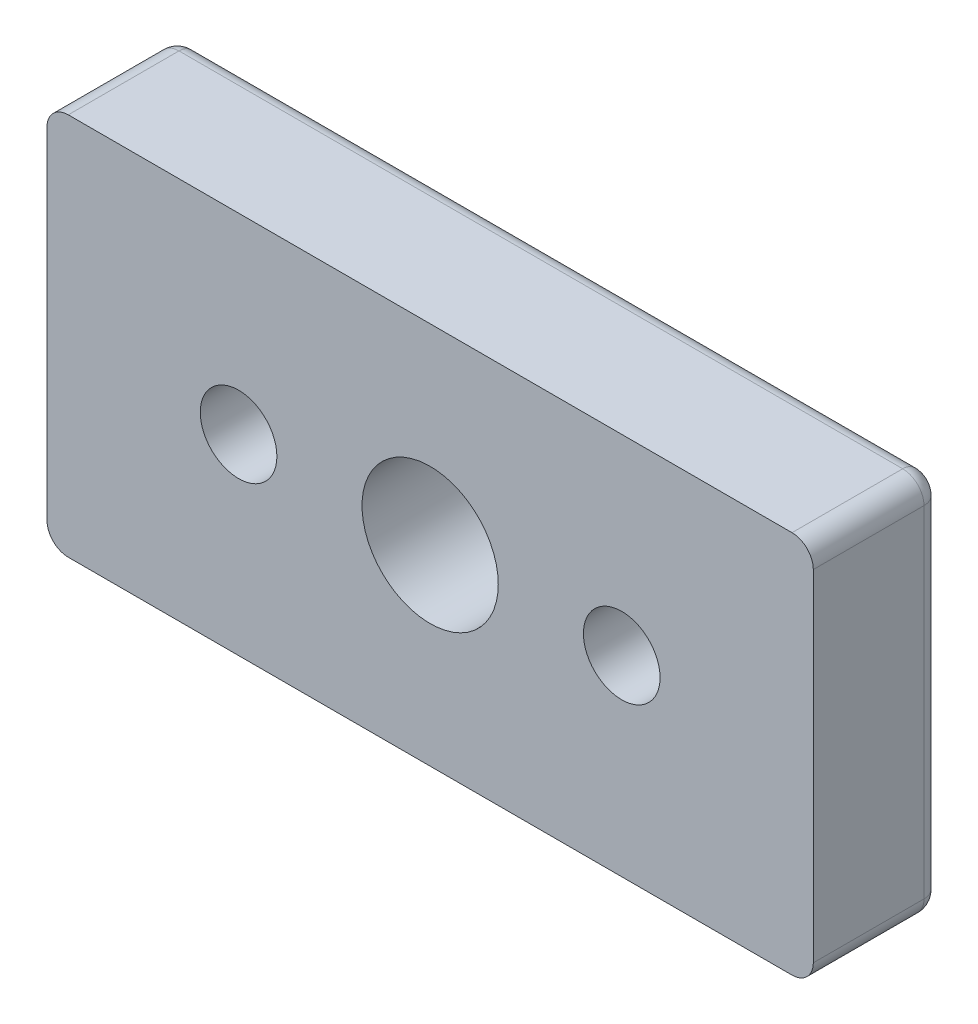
ISO-10303-21;
HEADER;
FILE_DESCRIPTION(('STEP AP214'),'2;1');
FILE_NAME('part.step','',(''),(''),'','','');
FILE_SCHEMA(('AUTOMOTIVE_DESIGN { 1 0 10303 214 1 1 1 1 }'));
ENDSEC;
DATA;
#1=APPLICATION_CONTEXT('core data for automotive mechanical design processes');
#2=APPLICATION_PROTOCOL_DEFINITION('international standard','automotive_design',2000,#1);
#3=PRODUCT_CONTEXT('',#1,'mechanical');
#4=PRODUCT('Part','Part','',(#3));
#5=PRODUCT_RELATED_PRODUCT_CATEGORY('part','',(#4));
#6=PRODUCT_DEFINITION_FORMATION('','',#4);
#7=PRODUCT_DEFINITION_CONTEXT('part definition',#1,'design');
#8=PRODUCT_DEFINITION('design','',#6,#7);
#9=PRODUCT_DEFINITION_SHAPE('','',#8);
#10=(LENGTH_UNIT() NAMED_UNIT(*) SI_UNIT(.MILLI.,.METRE.));
#11=(NAMED_UNIT(*) PLANE_ANGLE_UNIT() SI_UNIT($,.RADIAN.));
#12=(NAMED_UNIT(*) SI_UNIT($,.STERADIAN.) SOLID_ANGLE_UNIT());
#13=UNCERTAINTY_MEASURE_WITH_UNIT(LENGTH_MEASURE(1.E-05),#10,'distance_accuracy_value','');
#14=(GEOMETRIC_REPRESENTATION_CONTEXT(3) GLOBAL_UNCERTAINTY_ASSIGNED_CONTEXT((#13)) GLOBAL_UNIT_ASSIGNED_CONTEXT((#10,
#11,#12)) REPRESENTATION_CONTEXT('',''));
#15=CARTESIAN_POINT('',(0.,0.,0.));
#16=DIRECTION('',(0.,0.,1.));
#17=DIRECTION('',(1.,0.,0.));
#18=AXIS2_PLACEMENT_3D('',#15,#16,#17);
#19=CARTESIAN_POINT('',(22.5,0.,0.));
#20=DIRECTION('',(0.,0.,1.));
#21=DIRECTION('',(1.,0.,0.));
#22=AXIS2_PLACEMENT_3D('',#19,#20,#21);
#23=CYLINDRICAL_SURFACE('',#22,7.5);
#24=CARTESIAN_POINT('',(22.5,0.,5.5));
#25=DIRECTION('',(0.,0.,1.));
#26=DIRECTION('',(1.,0.,0.));
#27=AXIS2_PLACEMENT_3D('',#24,#25,#26);
#28=CIRCLE('',#27,7.5);
#29=CARTESIAN_POINT('',(30.,0.,5.5));
#30=VERTEX_POINT('',#29);
#31=EDGE_CURVE('E193',#30,#30,#28,.T.);
#32=ORIENTED_EDGE('',*,*,#31,.T.);
#33=EDGE_LOOP('',(#32));
#34=FACE_BOUND('',#33,.T.);
#35=CARTESIAN_POINT('',(22.5,0.,0.));
#36=DIRECTION('',(0.,0.,1.));
#37=DIRECTION('',(1.,0.,0.));
#38=AXIS2_PLACEMENT_3D('',#35,#36,#37);
#39=CIRCLE('',#38,7.5);
#40=CARTESIAN_POINT('',(30.,0.,0.));
#41=VERTEX_POINT('',#40);
#42=EDGE_CURVE('E196',#41,#41,#39,.F.);
#43=ORIENTED_EDGE('',*,*,#42,.T.);
#44=EDGE_LOOP('',(#43));
#45=FACE_BOUND('',#44,.T.);
#46=ADVANCED_FACE('F15',(#34,#45),#23,.F.);
#47=CARTESIAN_POINT('',(-22.5,0.,0.));
#48=DIRECTION('',(0.,0.,1.));
#49=DIRECTION('',(1.,0.,0.));
#50=AXIS2_PLACEMENT_3D('',#47,#48,#49);
#51=CYLINDRICAL_SURFACE('',#50,7.5);
#52=CARTESIAN_POINT('',(-22.5,0.,5.5));
#53=DIRECTION('',(0.,0.,1.));
#54=DIRECTION('',(1.,0.,0.));
#55=AXIS2_PLACEMENT_3D('',#52,#53,#54);
#56=CIRCLE('',#55,7.5);
#57=CARTESIAN_POINT('',(-15.,0.,5.5));
#58=VERTEX_POINT('',#57);
#59=EDGE_CURVE('E129',#58,#58,#56,.T.);
#60=ORIENTED_EDGE('',*,*,#59,.T.);
#61=EDGE_LOOP('',(#60));
#62=FACE_BOUND('',#61,.T.);
#63=CARTESIAN_POINT('',(-22.5,0.,0.));
#64=DIRECTION('',(0.,0.,1.));
#65=DIRECTION('',(1.,0.,0.));
#66=AXIS2_PLACEMENT_3D('',#63,#64,#65);
#67=CIRCLE('',#66,7.5);
#68=CARTESIAN_POINT('',(-15.,0.,0.));
#69=VERTEX_POINT('',#68);
#70=EDGE_CURVE('E199',#69,#69,#67,.F.);
#71=ORIENTED_EDGE('',*,*,#70,.T.);
#72=EDGE_LOOP('',(#71));
#73=FACE_BOUND('',#72,.T.);
#74=ADVANCED_FACE('F443',(#62,#73),#51,.F.);
#75=CARTESIAN_POINT('',(-21.25,20.5,2.));
#76=DIRECTION('',(-1.,0.,0.));
#77=DIRECTION('',(0.,0.,1.));
#78=AXIS2_PLACEMENT_3D('',#75,#76,#77);
#79=CYLINDRICAL_SURFACE('',#78,2.);
#80=CARTESIAN_POINT('',(-42.5,20.5,1.99999999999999));
#81=DIRECTION('',(-1.,0.,0.));
#82=DIRECTION('',(0.,0.,1.));
#83=AXIS2_PLACEMENT_3D('',#80,#81,#82);
#84=CIRCLE('',#83,2.);
#85=CARTESIAN_POINT('',(-42.5,22.5,2.));
#86=VERTEX_POINT('',#85);
#87=CARTESIAN_POINT('',(-42.5,20.5,0.));
#88=VERTEX_POINT('',#87);
#89=EDGE_CURVE('E84',#86,#88,#84,.T.);
#90=ORIENTED_EDGE('',*,*,#89,.F.);
#91=DIRECTION('',(1.,0.,0.));
#92=VECTOR('',#91,1.);
#93=CARTESIAN_POINT('',(-42.5,22.5,2.));
#94=LINE('',#93,#92);
#95=CARTESIAN_POINT('',(42.5,22.5,2.));
#96=VERTEX_POINT('',#95);
#97=EDGE_CURVE('E125',#96,#86,#94,.F.);
#98=ORIENTED_EDGE('',*,*,#97,.F.);
#99=CARTESIAN_POINT('',(42.5000000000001,20.5,1.99999999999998));
#100=DIRECTION('',(1.,0.,0.));
#101=DIRECTION('',(0.,0.,-1.));
#102=AXIS2_PLACEMENT_3D('',#99,#100,#101);
#103=CIRCLE('',#102,1.99999999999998);
#104=CARTESIAN_POINT('',(42.5,20.5,0.));
#105=VERTEX_POINT('',#104);
#106=EDGE_CURVE('E97',#105,#96,#103,.T.);
#107=ORIENTED_EDGE('',*,*,#106,.F.);
#108=DIRECTION('',(1.,0.,0.));
#109=VECTOR('',#108,1.);
#110=CARTESIAN_POINT('',(0.,20.5,0.));
#111=LINE('',#110,#109);
#112=EDGE_CURVE('E202',#105,#88,#111,.F.);
#113=ORIENTED_EDGE('',*,*,#112,.T.);
#114=EDGE_LOOP('',(#90,#98,#107,#113));
#115=FACE_BOUND('',#114,.T.);
#116=ADVANCED_FACE('F253',(#115),#79,.T.);
#117=CARTESIAN_POINT('',(-42.5,20.,2.));
#118=DIRECTION('',(0.,0.,-1.));
#119=DIRECTION('',(-1.,0.,0.));
#120=AXIS2_PLACEMENT_3D('',#117,#118,#119);
#121=DEGENERATE_TOROIDAL_SURFACE('',#120,0.5,2.,.T.);
#122=ORIENTED_EDGE('',*,*,#89,.T.);
#123=CARTESIAN_POINT('',(-42.5,20.,0.));
#124=DIRECTION('',(0.,0.,-1.));
#125=DIRECTION('',(-1.,0.,0.));
#126=AXIS2_PLACEMENT_3D('',#123,#124,#125);
#127=CIRCLE('',#126,0.500000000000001);
#128=CARTESIAN_POINT('',(-43.,20.,0.));
#129=VERTEX_POINT('',#128);
#130=EDGE_CURVE('E19',#88,#129,#127,.F.);
#131=ORIENTED_EDGE('',*,*,#130,.T.);
#132=CARTESIAN_POINT('',(-43.,20.,2.));
#133=DIRECTION('',(0.,-1.,0.));
#134=DIRECTION('',(0.,0.,-1.));
#135=AXIS2_PLACEMENT_3D('',#132,#133,#134);
#136=CIRCLE('',#135,2.);
#137=CARTESIAN_POINT('',(-45.,20.,2.));
#138=VERTEX_POINT('',#137);
#139=EDGE_CURVE('E91',#138,#129,#136,.T.);
#140=ORIENTED_EDGE('',*,*,#139,.F.);
#141=CARTESIAN_POINT('',(-42.5,20.,2.));
#142=DIRECTION('',(0.,0.,1.));
#143=DIRECTION('',(1.,0.,0.));
#144=AXIS2_PLACEMENT_3D('',#141,#142,#143);
#145=CIRCLE('',#144,2.5);
#146=EDGE_CURVE('E128',#86,#138,#145,.T.);
#147=ORIENTED_EDGE('',*,*,#146,.F.);
#148=EDGE_LOOP('',(#122,#131,#140,#147));
#149=FACE_BOUND('',#148,.T.);
#150=ADVANCED_FACE('F89',(#149),#121,.T.);
#151=CARTESIAN_POINT('',(-43.,-10.,2.));
#152=DIRECTION('',(0.,-1.,0.));
#153=DIRECTION('',(0.,0.,-1.));
#154=AXIS2_PLACEMENT_3D('',#151,#152,#153);
#155=CYLINDRICAL_SURFACE('',#154,2.);
#156=ORIENTED_EDGE('',*,*,#139,.T.);
#157=DIRECTION('',(0.,1.,0.));
#158=VECTOR('',#157,1.);
#159=CARTESIAN_POINT('',(-43.,0.,0.));
#160=LINE('',#159,#158);
#161=CARTESIAN_POINT('',(-43.,-20.,0.));
#162=VERTEX_POINT('',#161);
#163=EDGE_CURVE('E96',#129,#162,#160,.F.);
#164=ORIENTED_EDGE('',*,*,#163,.T.);
#165=CARTESIAN_POINT('',(-43.,-20.,2.00000000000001));
#166=DIRECTION('',(0.,-1.,0.));
#167=DIRECTION('',(0.,0.,-1.));
#168=AXIS2_PLACEMENT_3D('',#165,#166,#167);
#169=CIRCLE('',#168,2.);
#170=CARTESIAN_POINT('',(-45.,-20.,2.));
#171=VERTEX_POINT('',#170);
#172=EDGE_CURVE('E105',#171,#162,#169,.T.);
#173=ORIENTED_EDGE('',*,*,#172,.F.);
#174=DIRECTION('',(0.,1.,0.));
#175=VECTOR('',#174,1.);
#176=CARTESIAN_POINT('',(-45.,-20.,2.));
#177=LINE('',#176,#175);
#178=EDGE_CURVE('E103',#138,#171,#177,.F.);
#179=ORIENTED_EDGE('',*,*,#178,.F.);
#180=EDGE_LOOP('',(#156,#164,#173,#179));
#181=FACE_BOUND('',#180,.T.);
#182=ADVANCED_FACE('F99',(#181),#155,.T.);
#183=CARTESIAN_POINT('',(-42.5,-20.,2.00000000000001));
#184=DIRECTION('',(0.,0.,-1.));
#185=DIRECTION('',(-1.,0.,0.));
#186=AXIS2_PLACEMENT_3D('',#183,#184,#185);
#187=DEGENERATE_TOROIDAL_SURFACE('',#186,0.500000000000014,2.,.T.);
#188=ORIENTED_EDGE('',*,*,#172,.T.);
#189=CARTESIAN_POINT('',(-42.5,-20.,0.));
#190=DIRECTION('',(0.,0.,-1.));
#191=DIRECTION('',(-1.,0.,0.));
#192=AXIS2_PLACEMENT_3D('',#189,#190,#191);
#193=CIRCLE('',#192,0.49999999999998);
#194=CARTESIAN_POINT('',(-42.5,-20.5,0.));
#195=VERTEX_POINT('',#194);
#196=EDGE_CURVE('E111',#162,#195,#193,.F.);
#197=ORIENTED_EDGE('',*,*,#196,.T.);
#198=CARTESIAN_POINT('',(-42.5,-20.5,2.));
#199=DIRECTION('',(1.,0.,0.));
#200=DIRECTION('',(0.,0.,-1.));
#201=AXIS2_PLACEMENT_3D('',#198,#199,#200);
#202=CIRCLE('',#201,2.);
#203=CARTESIAN_POINT('',(-42.5,-22.5,2.));
#204=VERTEX_POINT('',#203);
#205=EDGE_CURVE('E149',#204,#195,#202,.T.);
#206=ORIENTED_EDGE('',*,*,#205,.F.);
#207=CARTESIAN_POINT('',(-42.5,-20.,2.));
#208=DIRECTION('',(0.,0.,1.));
#209=DIRECTION('',(1.,0.,0.));
#210=AXIS2_PLACEMENT_3D('',#207,#208,#209);
#211=CIRCLE('',#210,2.50000000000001);
#212=EDGE_CURVE('E150',#171,#204,#211,.T.);
#213=ORIENTED_EDGE('',*,*,#212,.F.);
#214=EDGE_LOOP('',(#188,#197,#206,#213));
#215=FACE_BOUND('',#214,.T.);
#216=ADVANCED_FACE('F282',(#215),#187,.T.);
#217=CARTESIAN_POINT('',(21.25,-20.5,2.));
#218=DIRECTION('',(1.,0.,0.));
#219=DIRECTION('',(0.,0.,-1.));
#220=AXIS2_PLACEMENT_3D('',#217,#218,#219);
#221=CYLINDRICAL_SURFACE('',#220,2.);
#222=ORIENTED_EDGE('',*,*,#205,.T.);
#223=DIRECTION('',(1.,0.,0.));
#224=VECTOR('',#223,1.);
#225=CARTESIAN_POINT('',(0.,-20.5,0.));
#226=LINE('',#225,#224);
#227=CARTESIAN_POINT('',(42.5,-20.5,0.));
#228=VERTEX_POINT('',#227);
#229=EDGE_CURVE('E113',#195,#228,#226,.T.);
#230=ORIENTED_EDGE('',*,*,#229,.T.);
#231=CARTESIAN_POINT('',(42.4999999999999,-20.5,2.));
#232=DIRECTION('',(1.,0.,0.));
#233=DIRECTION('',(0.,0.,-1.));
#234=AXIS2_PLACEMENT_3D('',#231,#232,#233);
#235=CIRCLE('',#234,2.);
#236=CARTESIAN_POINT('',(42.5,-22.5,2.));
#237=VERTEX_POINT('',#236);
#238=EDGE_CURVE('E142',#237,#228,#235,.T.);
#239=ORIENTED_EDGE('',*,*,#238,.F.);
#240=DIRECTION('',(1.,0.,0.));
#241=VECTOR('',#240,1.);
#242=CARTESIAN_POINT('',(42.5,-22.5,2.));
#243=LINE('',#242,#241);
#244=EDGE_CURVE('E143',#204,#237,#243,.T.);
#245=ORIENTED_EDGE('',*,*,#244,.F.);
#246=EDGE_LOOP('',(#222,#230,#239,#245));
#247=FACE_BOUND('',#246,.T.);
#248=ADVANCED_FACE('F213',(#247),#221,.T.);
#249=CARTESIAN_POINT('',(42.5,-20.,2.00000000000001));
#250=DIRECTION('',(0.,0.,-1.));
#251=DIRECTION('',(-1.,0.,0.));
#252=AXIS2_PLACEMENT_3D('',#249,#250,#251);
#253=DEGENERATE_TOROIDAL_SURFACE('',#252,0.500000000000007,2.00000000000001,.T.);
#254=CARTESIAN_POINT('',(43.,-20.,2.));
#255=DIRECTION('',(0.,1.,0.));
#256=DIRECTION('',(0.,0.,1.));
#257=AXIS2_PLACEMENT_3D('',#254,#255,#256);
#258=CIRCLE('',#257,2.);
#259=CARTESIAN_POINT('',(45.,-20.,2.));
#260=VERTEX_POINT('',#259);
#261=CARTESIAN_POINT('',(43.,-20.,0.));
#262=VERTEX_POINT('',#261);
#263=EDGE_CURVE('E133',#260,#262,#258,.T.);
#264=ORIENTED_EDGE('',*,*,#263,.F.);
#265=CARTESIAN_POINT('',(42.5,-20.,2.));
#266=DIRECTION('',(0.,0.,1.));
#267=DIRECTION('',(1.,0.,0.));
#268=AXIS2_PLACEMENT_3D('',#265,#266,#267);
#269=CIRCLE('',#268,2.5);
#270=EDGE_CURVE('E136',#237,#260,#269,.T.);
#271=ORIENTED_EDGE('',*,*,#270,.F.);
#272=ORIENTED_EDGE('',*,*,#238,.T.);
#273=CARTESIAN_POINT('',(42.5,-20.,0.));
#274=DIRECTION('',(0.,0.,-1.));
#275=DIRECTION('',(-1.,0.,0.));
#276=AXIS2_PLACEMENT_3D('',#273,#274,#275);
#277=CIRCLE('',#276,0.500000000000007);
#278=EDGE_CURVE('E207',#228,#262,#277,.F.);
#279=ORIENTED_EDGE('',*,*,#278,.T.);
#280=EDGE_LOOP('',(#264,#271,#272,#279));
#281=FACE_BOUND('',#280,.T.);
#282=ADVANCED_FACE('F218',(#281),#253,.T.);
#283=CARTESIAN_POINT('',(43.,10.,2.));
#284=DIRECTION('',(0.,1.,0.));
#285=DIRECTION('',(0.,0.,1.));
#286=AXIS2_PLACEMENT_3D('',#283,#284,#285);
#287=CYLINDRICAL_SURFACE('',#286,2.);
#288=CARTESIAN_POINT('',(43.,20.,1.99999999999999));
#289=DIRECTION('',(0.,1.,0.));
#290=DIRECTION('',(0.,0.,1.));
#291=AXIS2_PLACEMENT_3D('',#288,#289,#290);
#292=CIRCLE('',#291,1.99999999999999);
#293=CARTESIAN_POINT('',(45.,20.,2.));
#294=VERTEX_POINT('',#293);
#295=CARTESIAN_POINT('',(43.,20.,0.));
#296=VERTEX_POINT('',#295);
#297=EDGE_CURVE('E130',#294,#296,#292,.T.);
#298=ORIENTED_EDGE('',*,*,#297,.F.);
#299=DIRECTION('',(0.,1.,0.));
#300=VECTOR('',#299,1.);
#301=CARTESIAN_POINT('',(45.,20.,2.));
#302=LINE('',#301,#300);
#303=EDGE_CURVE('E117',#260,#294,#302,.T.);
#304=ORIENTED_EDGE('',*,*,#303,.F.);
#305=ORIENTED_EDGE('',*,*,#263,.T.);
#306=DIRECTION('',(0.,1.,0.));
#307=VECTOR('',#306,1.);
#308=CARTESIAN_POINT('',(43.,0.,0.));
#309=LINE('',#308,#307);
#310=EDGE_CURVE('E206',#262,#296,#309,.T.);
#311=ORIENTED_EDGE('',*,*,#310,.T.);
#312=EDGE_LOOP('',(#298,#304,#305,#311));
#313=FACE_BOUND('',#312,.T.);
#314=ADVANCED_FACE('F222',(#313),#287,.T.);
#315=CARTESIAN_POINT('',(42.5,20.,2.));
#316=DIRECTION('',(0.,0.,-1.));
#317=DIRECTION('',(0.,1.,0.));
#318=AXIS2_PLACEMENT_3D('',#315,#316,#317);
#319=DEGENERATE_TOROIDAL_SURFACE('',#318,0.499999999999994,2.,.T.);
#320=ORIENTED_EDGE('',*,*,#106,.T.);
#321=CARTESIAN_POINT('',(42.5,20.,2.));
#322=DIRECTION('',(0.,0.,1.));
#323=DIRECTION('',(1.,0.,0.));
#324=AXIS2_PLACEMENT_3D('',#321,#322,#323);
#325=CIRCLE('',#324,2.5);
#326=EDGE_CURVE('E121',#294,#96,#325,.T.);
#327=ORIENTED_EDGE('',*,*,#326,.F.);
#328=ORIENTED_EDGE('',*,*,#297,.T.);
#329=CARTESIAN_POINT('',(42.5,20.,0.));
#330=DIRECTION('',(0.,0.,-1.));
#331=DIRECTION('',(0.,1.,0.));
#332=AXIS2_PLACEMENT_3D('',#329,#330,#331);
#333=CIRCLE('',#332,0.500000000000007);
#334=EDGE_CURVE('E203',#296,#105,#333,.F.);
#335=ORIENTED_EDGE('',*,*,#334,.T.);
#336=EDGE_LOOP('',(#320,#327,#328,#335));
#337=FACE_BOUND('',#336,.T.);
#338=ADVANCED_FACE('F227',(#337),#319,.T.);
#339=CARTESIAN_POINT('',(0.,0.,0.));
#340=DIRECTION('',(0.,0.,1.));
#341=DIRECTION('',(1.,0.,0.));
#342=AXIS2_PLACEMENT_3D('',#339,#340,#341);
#343=PLANE('',#342);
#344=ORIENTED_EDGE('',*,*,#42,.F.);
#345=EDGE_LOOP('',(#344));
#346=FACE_BOUND('',#345,.T.);
#347=ORIENTED_EDGE('',*,*,#70,.F.);
#348=EDGE_LOOP('',(#347));
#349=FACE_BOUND('',#348,.T.);
#350=CARTESIAN_POINT('',(0.,0.,0.));
#351=DIRECTION('',(0.,0.,1.));
#352=DIRECTION('',(1.,0.,0.));
#353=AXIS2_PLACEMENT_3D('',#350,#351,#352);
#354=CIRCLE('',#353,8.);
#355=CARTESIAN_POINT('',(8.,0.,0.));
#356=VERTEX_POINT('',#355);
#357=EDGE_CURVE('E188',#356,#356,#354,.T.);
#358=ORIENTED_EDGE('',*,*,#357,.T.);
#359=EDGE_LOOP('',(#358));
#360=FACE_BOUND('',#359,.T.);
#361=ORIENTED_EDGE('',*,*,#334,.F.);
#362=ORIENTED_EDGE('',*,*,#310,.F.);
#363=ORIENTED_EDGE('',*,*,#278,.F.);
#364=ORIENTED_EDGE('',*,*,#229,.F.);
#365=ORIENTED_EDGE('',*,*,#196,.F.);
#366=ORIENTED_EDGE('',*,*,#163,.F.);
#367=ORIENTED_EDGE('',*,*,#130,.F.);
#368=ORIENTED_EDGE('',*,*,#112,.F.);
#369=EDGE_LOOP('',(#361,#362,#363,#364,#365,#366,#367,#368));
#370=FACE_BOUND('',#369,.T.);
#371=ADVANCED_FACE('F109',(#346,#349,#360,#370),#343,.F.);
#372=CARTESIAN_POINT('',(30.15,7.65,5.5));
#373=DIRECTION('',(0.,0.,1.));
#374=DIRECTION('',(-1.,0.,0.));
#375=AXIS2_PLACEMENT_3D('',#372,#373,#374);
#376=PLANE('',#375);
#377=CARTESIAN_POINT('',(22.5,0.,5.5));
#378=DIRECTION('',(0.,0.,1.));
#379=DIRECTION('',(1.,0.,0.));
#380=AXIS2_PLACEMENT_3D('',#377,#378,#379);
#381=CIRCLE('',#380,4.5);
#382=CARTESIAN_POINT('',(27.,0.,5.5));
#383=VERTEX_POINT('',#382);
#384=EDGE_CURVE('E185',#383,#383,#381,.T.);
#385=ORIENTED_EDGE('',*,*,#384,.T.);
#386=EDGE_LOOP('',(#385));
#387=FACE_BOUND('',#386,.T.);
#388=ORIENTED_EDGE('',*,*,#31,.F.);
#389=EDGE_LOOP('',(#388));
#390=FACE_BOUND('',#389,.T.);
#391=ADVANCED_FACE('F381',(#387,#390),#376,.F.);
#392=CARTESIAN_POINT('',(-14.85,7.65,5.5));
#393=DIRECTION('',(0.,0.,1.));
#394=DIRECTION('',(-1.,0.,0.));
#395=AXIS2_PLACEMENT_3D('',#392,#393,#394);
#396=PLANE('',#395);
#397=CARTESIAN_POINT('',(-22.5,0.,5.5));
#398=DIRECTION('',(0.,0.,1.));
#399=DIRECTION('',(1.,0.,0.));
#400=AXIS2_PLACEMENT_3D('',#397,#398,#399);
#401=CIRCLE('',#400,4.5);
#402=CARTESIAN_POINT('',(-18.,0.,5.5));
#403=VERTEX_POINT('',#402);
#404=EDGE_CURVE('E182',#403,#403,#401,.T.);
#405=ORIENTED_EDGE('',*,*,#404,.T.);
#406=EDGE_LOOP('',(#405));
#407=FACE_BOUND('',#406,.T.);
#408=ORIENTED_EDGE('',*,*,#59,.F.);
#409=EDGE_LOOP('',(#408));
#410=FACE_BOUND('',#409,.T.);
#411=ADVANCED_FACE('F17',(#407,#410),#396,.F.);
#412=CARTESIAN_POINT('',(-42.5,22.5,0.));
#413=DIRECTION('',(0.,1.,0.));
#414=DIRECTION('',(0.,0.,1.));
#415=AXIS2_PLACEMENT_3D('',#412,#413,#414);
#416=PLANE('',#415);
#417=DIRECTION('',(1.,0.,0.));
#418=VECTOR('',#417,1.);
#419=CARTESIAN_POINT('',(0.,22.5,15.));
#420=LINE('',#419,#418);
#421=CARTESIAN_POINT('',(42.5,22.5,15.));
#422=VERTEX_POINT('',#421);
#423=CARTESIAN_POINT('',(-42.5,22.5,15.));
#424=VERTEX_POINT('',#423);
#425=EDGE_CURVE('E181',#422,#424,#420,.F.);
#426=ORIENTED_EDGE('',*,*,#425,.F.);
#427=DIRECTION('',(0.,0.,1.));
#428=VECTOR('',#427,1.);
#429=CARTESIAN_POINT('',(42.5,22.5,0.));
#430=LINE('',#429,#428);
#431=EDGE_CURVE('E124',#96,#422,#430,.T.);
#432=ORIENTED_EDGE('',*,*,#431,.F.);
#433=ORIENTED_EDGE('',*,*,#97,.T.);
#434=DIRECTION('',(0.,0.,1.));
#435=VECTOR('',#434,1.);
#436=CARTESIAN_POINT('',(-42.5,22.5,0.));
#437=LINE('',#436,#435);
#438=EDGE_CURVE('E157',#424,#86,#437,.F.);
#439=ORIENTED_EDGE('',*,*,#438,.F.);
#440=EDGE_LOOP('',(#426,#432,#433,#439));
#441=FACE_BOUND('',#440,.T.);
#442=ADVANCED_FACE('F257',(#441),#416,.T.);
#443=CARTESIAN_POINT('',(-42.5,20.,0.));
#444=DIRECTION('',(0.,0.,1.));
#445=DIRECTION('',(1.,0.,0.));
#446=AXIS2_PLACEMENT_3D('',#443,#444,#445);
#447=CYLINDRICAL_SURFACE('',#446,2.5);
#448=CARTESIAN_POINT('',(-42.5,20.,15.));
#449=DIRECTION('',(0.,0.,1.));
#450=DIRECTION('',(1.,0.,0.));
#451=AXIS2_PLACEMENT_3D('',#448,#449,#450);
#452=CIRCLE('',#451,2.5);
#453=CARTESIAN_POINT('',(-45.,20.,15.));
#454=VERTEX_POINT('',#453);
#455=EDGE_CURVE('E178',#424,#454,#452,.T.);
#456=ORIENTED_EDGE('',*,*,#455,.F.);
#457=ORIENTED_EDGE('',*,*,#438,.T.);
#458=ORIENTED_EDGE('',*,*,#146,.T.);
#459=DIRECTION('',(0.,0.,1.));
#460=VECTOR('',#459,1.);
#461=CARTESIAN_POINT('',(-45.,20.,0.));
#462=LINE('',#461,#460);
#463=EDGE_CURVE('E153',#454,#138,#462,.F.);
#464=ORIENTED_EDGE('',*,*,#463,.F.);
#465=EDGE_LOOP('',(#456,#457,#458,#464));
#466=FACE_BOUND('',#465,.T.);
#467=ADVANCED_FACE('F260',(#466),#447,.T.);
#468=CARTESIAN_POINT('',(-45.,-20.,0.));
#469=DIRECTION('',(-1.,0.,0.));
#470=DIRECTION('',(0.,0.,1.));
#471=AXIS2_PLACEMENT_3D('',#468,#469,#470);
#472=PLANE('',#471);
#473=DIRECTION('',(0.,1.,0.));
#474=VECTOR('',#473,1.);
#475=CARTESIAN_POINT('',(-45.,0.,15.));
#476=LINE('',#475,#474);
#477=CARTESIAN_POINT('',(-45.,-20.,15.));
#478=VERTEX_POINT('',#477);
#479=EDGE_CURVE('E177',#454,#478,#476,.F.);
#480=ORIENTED_EDGE('',*,*,#479,.F.);
#481=ORIENTED_EDGE('',*,*,#463,.T.);
#482=ORIENTED_EDGE('',*,*,#178,.T.);
#483=DIRECTION('',(0.,0.,1.));
#484=VECTOR('',#483,1.);
#485=CARTESIAN_POINT('',(-45.,-20.,0.));
#486=LINE('',#485,#484);
#487=EDGE_CURVE('E146',#478,#171,#486,.F.);
#488=ORIENTED_EDGE('',*,*,#487,.F.);
#489=EDGE_LOOP('',(#480,#481,#482,#488));
#490=FACE_BOUND('',#489,.T.);
#491=ADVANCED_FACE('F285',(#490),#472,.T.);
#492=CARTESIAN_POINT('',(-42.5,-20.,0.));
#493=DIRECTION('',(0.,0.,1.));
#494=DIRECTION('',(1.,0.,0.));
#495=AXIS2_PLACEMENT_3D('',#492,#493,#494);
#496=CYLINDRICAL_SURFACE('',#495,2.50000000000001);
#497=CARTESIAN_POINT('',(-42.5,-20.,15.));
#498=DIRECTION('',(0.,0.,1.));
#499=DIRECTION('',(1.,0.,0.));
#500=AXIS2_PLACEMENT_3D('',#497,#498,#499);
#501=CIRCLE('',#500,2.50000000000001);
#502=CARTESIAN_POINT('',(-42.5,-22.5,15.));
#503=VERTEX_POINT('',#502);
#504=EDGE_CURVE('E174',#478,#503,#501,.T.);
#505=ORIENTED_EDGE('',*,*,#504,.F.);
#506=ORIENTED_EDGE('',*,*,#487,.T.);
#507=ORIENTED_EDGE('',*,*,#212,.T.);
#508=DIRECTION('',(0.,0.,-1.));
#509=VECTOR('',#508,1.);
#510=CARTESIAN_POINT('',(-42.5,-22.5,0.));
#511=LINE('',#510,#509);
#512=EDGE_CURVE('E139',#503,#204,#511,.T.);
#513=ORIENTED_EDGE('',*,*,#512,.F.);
#514=EDGE_LOOP('',(#505,#506,#507,#513));
#515=FACE_BOUND('',#514,.T.);
#516=ADVANCED_FACE('F287',(#515),#496,.T.);
#517=CARTESIAN_POINT('',(42.5,-22.5,0.));
#518=DIRECTION('',(0.,-1.,0.));
#519=DIRECTION('',(0.,0.,-1.));
#520=AXIS2_PLACEMENT_3D('',#517,#518,#519);
#521=PLANE('',#520);
#522=DIRECTION('',(1.,0.,0.));
#523=VECTOR('',#522,1.);
#524=CARTESIAN_POINT('',(0.,-22.5,15.));
#525=LINE('',#524,#523);
#526=CARTESIAN_POINT('',(42.5,-22.5,15.));
#527=VERTEX_POINT('',#526);
#528=EDGE_CURVE('E173',#503,#527,#525,.T.);
#529=ORIENTED_EDGE('',*,*,#528,.F.);
#530=ORIENTED_EDGE('',*,*,#512,.T.);
#531=ORIENTED_EDGE('',*,*,#244,.T.);
#532=DIRECTION('',(0.,0.,1.));
#533=VECTOR('',#532,1.);
#534=CARTESIAN_POINT('',(42.5,-22.5,0.));
#535=LINE('',#534,#533);
#536=EDGE_CURVE('E120',#527,#237,#535,.F.);
#537=ORIENTED_EDGE('',*,*,#536,.F.);
#538=EDGE_LOOP('',(#529,#530,#531,#537));
#539=FACE_BOUND('',#538,.T.);
#540=ADVANCED_FACE('F289',(#539),#521,.T.);
#541=CARTESIAN_POINT('',(42.5,-20.,0.));
#542=DIRECTION('',(0.,0.,1.));
#543=DIRECTION('',(1.,0.,0.));
#544=AXIS2_PLACEMENT_3D('',#541,#542,#543);
#545=CYLINDRICAL_SURFACE('',#544,2.5);
#546=CARTESIAN_POINT('',(42.5,-20.,15.));
#547=DIRECTION('',(0.,0.,1.));
#548=DIRECTION('',(1.,0.,0.));
#549=AXIS2_PLACEMENT_3D('',#546,#547,#548);
#550=CIRCLE('',#549,2.5);
#551=CARTESIAN_POINT('',(45.,-20.,15.));
#552=VERTEX_POINT('',#551);
#553=EDGE_CURVE('E170',#527,#552,#550,.T.);
#554=ORIENTED_EDGE('',*,*,#553,.F.);
#555=ORIENTED_EDGE('',*,*,#536,.T.);
#556=ORIENTED_EDGE('',*,*,#270,.T.);
#557=DIRECTION('',(0.,0.,-1.));
#558=VECTOR('',#557,1.);
#559=CARTESIAN_POINT('',(45.,-20.,0.));
#560=LINE('',#559,#558);
#561=EDGE_CURVE('E119',#552,#260,#560,.T.);
#562=ORIENTED_EDGE('',*,*,#561,.F.);
#563=EDGE_LOOP('',(#554,#555,#556,#562));
#564=FACE_BOUND('',#563,.T.);
#565=ADVANCED_FACE('F273',(#564),#545,.T.);
#566=CARTESIAN_POINT('',(45.,20.,0.));
#567=DIRECTION('',(1.,0.,0.));
#568=DIRECTION('',(0.,0.,-1.));
#569=AXIS2_PLACEMENT_3D('',#566,#567,#568);
#570=PLANE('',#569);
#571=DIRECTION('',(0.,1.,0.));
#572=VECTOR('',#571,1.);
#573=CARTESIAN_POINT('',(45.,0.,15.));
#574=LINE('',#573,#572);
#575=CARTESIAN_POINT('',(45.,20.,15.));
#576=VERTEX_POINT('',#575);
#577=EDGE_CURVE('E169',#552,#576,#574,.T.);
#578=ORIENTED_EDGE('',*,*,#577,.F.);
#579=ORIENTED_EDGE('',*,*,#561,.T.);
#580=ORIENTED_EDGE('',*,*,#303,.T.);
#581=DIRECTION('',(0.,0.,1.));
#582=VECTOR('',#581,1.);
#583=CARTESIAN_POINT('',(45.,20.,0.));
#584=LINE('',#583,#582);
#585=EDGE_CURVE('E34',#576,#294,#584,.F.);
#586=ORIENTED_EDGE('',*,*,#585,.F.);
#587=EDGE_LOOP('',(#578,#579,#580,#586));
#588=FACE_BOUND('',#587,.T.);
#589=ADVANCED_FACE('F234',(#588),#570,.T.);
#590=CARTESIAN_POINT('',(42.5,20.,0.));
#591=DIRECTION('',(0.,0.,1.));
#592=DIRECTION('',(1.,0.,0.));
#593=AXIS2_PLACEMENT_3D('',#590,#591,#592);
#594=CYLINDRICAL_SURFACE('',#593,2.5);
#595=CARTESIAN_POINT('',(42.5,20.,15.));
#596=DIRECTION('',(0.,0.,1.));
#597=DIRECTION('',(1.,0.,0.));
#598=AXIS2_PLACEMENT_3D('',#595,#596,#597);
#599=CIRCLE('',#598,2.5);
#600=EDGE_CURVE('E166',#576,#422,#599,.T.);
#601=ORIENTED_EDGE('',*,*,#600,.F.);
#602=ORIENTED_EDGE('',*,*,#585,.T.);
#603=ORIENTED_EDGE('',*,*,#326,.T.);
#604=ORIENTED_EDGE('',*,*,#431,.T.);
#605=EDGE_LOOP('',(#601,#602,#603,#604));
#606=FACE_BOUND('',#605,.T.);
#607=ADVANCED_FACE('F235',(#606),#594,.T.);
#608=CARTESIAN_POINT('',(0.,0.,0.));
#609=DIRECTION('',(0.,0.,1.));
#610=DIRECTION('',(1.,0.,0.));
#611=AXIS2_PLACEMENT_3D('',#608,#609,#610);
#612=CYLINDRICAL_SURFACE('',#611,8.);
#613=ORIENTED_EDGE('',*,*,#357,.F.);
#614=EDGE_LOOP('',(#613));
#615=FACE_BOUND('',#614,.T.);
#616=CARTESIAN_POINT('',(0.,0.,15.));
#617=DIRECTION('',(0.,0.,1.));
#618=DIRECTION('',(1.,0.,0.));
#619=AXIS2_PLACEMENT_3D('',#616,#617,#618);
#620=CIRCLE('',#619,8.);
#621=CARTESIAN_POINT('',(8.,0.,15.));
#622=VERTEX_POINT('',#621);
#623=EDGE_CURVE('E163',#622,#622,#620,.F.);
#624=ORIENTED_EDGE('',*,*,#623,.F.);
#625=EDGE_LOOP('',(#624));
#626=FACE_BOUND('',#625,.T.);
#627=ADVANCED_FACE('F313',(#615,#626),#612,.F.);
#628=CARTESIAN_POINT('',(22.5,0.,0.));
#629=DIRECTION('',(0.,0.,1.));
#630=DIRECTION('',(1.,0.,0.));
#631=AXIS2_PLACEMENT_3D('',#628,#629,#630);
#632=CYLINDRICAL_SURFACE('',#631,4.5);
#633=CARTESIAN_POINT('',(22.5,0.,15.));
#634=DIRECTION('',(0.,0.,1.));
#635=DIRECTION('',(1.,0.,0.));
#636=AXIS2_PLACEMENT_3D('',#633,#634,#635);
#637=CIRCLE('',#636,4.5);
#638=CARTESIAN_POINT('',(27.,0.,15.));
#639=VERTEX_POINT('',#638);
#640=EDGE_CURVE('E25',#639,#639,#637,.F.);
#641=ORIENTED_EDGE('',*,*,#640,.F.);
#642=EDGE_LOOP('',(#641));
#643=FACE_BOUND('',#642,.T.);
#644=ORIENTED_EDGE('',*,*,#384,.F.);
#645=EDGE_LOOP('',(#644));
#646=FACE_BOUND('',#645,.T.);
#647=ADVANCED_FACE('F306',(#643,#646),#632,.F.);
#648=CARTESIAN_POINT('',(-22.5,0.,0.));
#649=DIRECTION('',(0.,0.,1.));
#650=DIRECTION('',(1.,0.,0.));
#651=AXIS2_PLACEMENT_3D('',#648,#649,#650);
#652=CYLINDRICAL_SURFACE('',#651,4.5);
#653=CARTESIAN_POINT('',(-22.5,0.,15.));
#654=DIRECTION('',(0.,0.,1.));
#655=DIRECTION('',(1.,0.,0.));
#656=AXIS2_PLACEMENT_3D('',#653,#654,#655);
#657=CIRCLE('',#656,4.5);
#658=CARTESIAN_POINT('',(-18.,0.,15.));
#659=VERTEX_POINT('',#658);
#660=EDGE_CURVE('E10',#659,#659,#657,.F.);
#661=ORIENTED_EDGE('',*,*,#660,.F.);
#662=EDGE_LOOP('',(#661));
#663=FACE_BOUND('',#662,.T.);
#664=ORIENTED_EDGE('',*,*,#404,.F.);
#665=EDGE_LOOP('',(#664));
#666=FACE_BOUND('',#665,.T.);
#667=ADVANCED_FACE('F300',(#663,#666),#652,.F.);
#668=CARTESIAN_POINT('',(0.,0.,15.));
#669=DIRECTION('',(0.,0.,1.));
#670=DIRECTION('',(1.,0.,0.));
#671=AXIS2_PLACEMENT_3D('',#668,#669,#670);
#672=PLANE('',#671);
#673=ORIENTED_EDGE('',*,*,#660,.T.);
#674=EDGE_LOOP('',(#673));
#675=FACE_BOUND('',#674,.T.);
#676=ORIENTED_EDGE('',*,*,#640,.T.);
#677=EDGE_LOOP('',(#676));
#678=FACE_BOUND('',#677,.T.);
#679=ORIENTED_EDGE('',*,*,#623,.T.);
#680=EDGE_LOOP('',(#679));
#681=FACE_BOUND('',#680,.T.);
#682=ORIENTED_EDGE('',*,*,#577,.T.);
#683=ORIENTED_EDGE('',*,*,#600,.T.);
#684=ORIENTED_EDGE('',*,*,#425,.T.);
#685=ORIENTED_EDGE('',*,*,#455,.T.);
#686=ORIENTED_EDGE('',*,*,#479,.T.);
#687=ORIENTED_EDGE('',*,*,#504,.T.);
#688=ORIENTED_EDGE('',*,*,#528,.T.);
#689=ORIENTED_EDGE('',*,*,#553,.T.);
#690=EDGE_LOOP('',(#682,#683,#684,#685,#686,#687,#688,#689));
#691=FACE_BOUND('',#690,.T.);
#692=ADVANCED_FACE('F265',(#675,#678,#681,#691),#672,.T.);
#693=CLOSED_SHELL('',(#46,#74,#116,#150,#182,#216,#248,#282,#314,#338,#371,#391,#411,#442,#467,
#491,#516,#540,#565,#589,#607,#627,#647,#667,#692));
#694=MANIFOLD_SOLID_BREP('B1',#693);
#695=ADVANCED_BREP_SHAPE_REPRESENTATION('',(#18,#694),#14);
#696=SHAPE_DEFINITION_REPRESENTATION(#9,#695);
ENDSEC;
END-ISO-10303-21;
